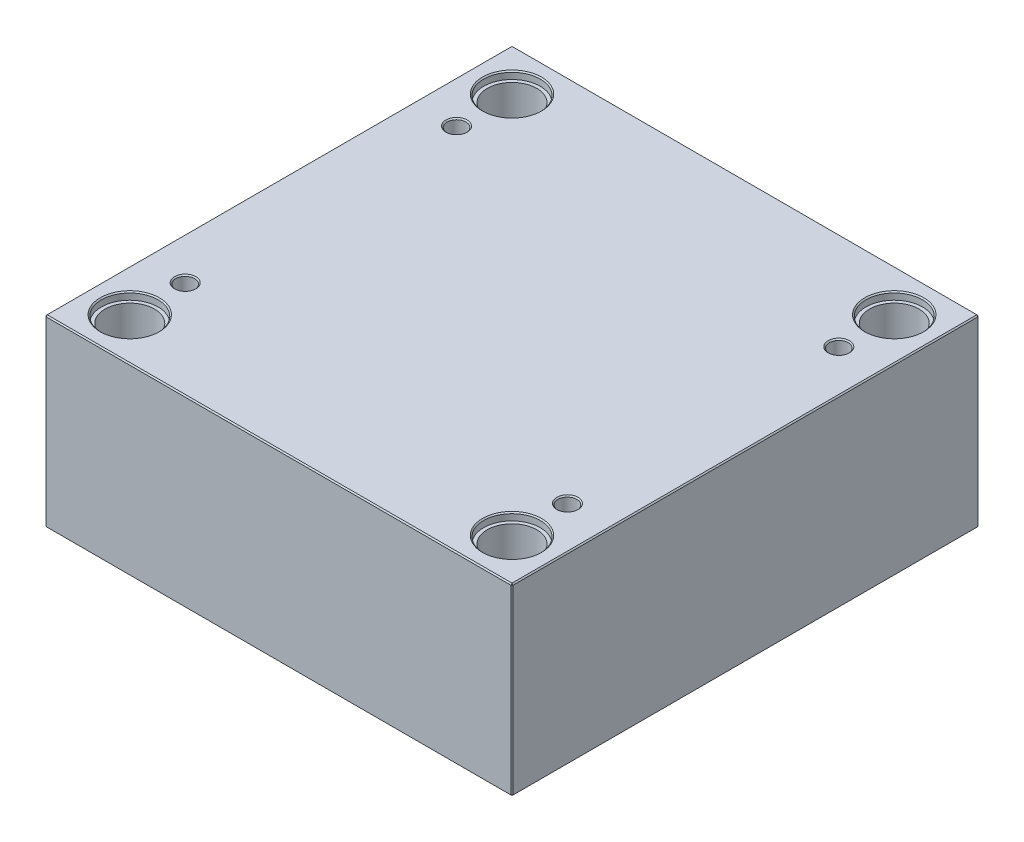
ISO-10303-21;
HEADER;
FILE_DESCRIPTION(('STEP AP214'),'2;1');
FILE_NAME('part.step','',(''),(''),'','','');
FILE_SCHEMA(('AUTOMOTIVE_DESIGN { 1 0 10303 214 1 1 1 1 }'));
ENDSEC;
DATA;
#1=APPLICATION_CONTEXT('core data for automotive mechanical design processes');
#2=APPLICATION_PROTOCOL_DEFINITION('international standard','automotive_design',2000,#1);
#3=PRODUCT_CONTEXT('',#1,'mechanical');
#4=PRODUCT('Part','Part','',(#3));
#5=PRODUCT_RELATED_PRODUCT_CATEGORY('part','',(#4));
#6=PRODUCT_DEFINITION_FORMATION('','',#4);
#7=PRODUCT_DEFINITION_CONTEXT('part definition',#1,'design');
#8=PRODUCT_DEFINITION('design','',#6,#7);
#9=PRODUCT_DEFINITION_SHAPE('','',#8);
#10=(LENGTH_UNIT() NAMED_UNIT(*) SI_UNIT(.MILLI.,.METRE.));
#11=(NAMED_UNIT(*) PLANE_ANGLE_UNIT() SI_UNIT($,.RADIAN.));
#12=(NAMED_UNIT(*) SI_UNIT($,.STERADIAN.) SOLID_ANGLE_UNIT());
#13=UNCERTAINTY_MEASURE_WITH_UNIT(LENGTH_MEASURE(1.E-05),#10,'distance_accuracy_value','');
#14=(GEOMETRIC_REPRESENTATION_CONTEXT(3) GLOBAL_UNCERTAINTY_ASSIGNED_CONTEXT((#13)) GLOBAL_UNIT_ASSIGNED_CONTEXT((#10,
#11,#12)) REPRESENTATION_CONTEXT('',''));
#15=CARTESIAN_POINT('',(0.,0.,0.));
#16=DIRECTION('',(0.,0.,1.));
#17=DIRECTION('',(1.,0.,0.));
#18=AXIS2_PLACEMENT_3D('',#15,#16,#17);
#19=CARTESIAN_POINT('',(-162.,0.,-162.));
#20=DIRECTION('',(0.,1.,0.));
#21=DIRECTION('',(0.,0.,1.));
#22=AXIS2_PLACEMENT_3D('',#19,#20,#21);
#23=CYLINDRICAL_SURFACE('',#22,21.);
#24=CARTESIAN_POINT('',(-162.,1.00000000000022,-162.));
#25=DIRECTION('',(0.,1.,0.));
#26=DIRECTION('',(0.,0.,1.));
#27=AXIS2_PLACEMENT_3D('',#24,#25,#26);
#28=CIRCLE('',#27,21.);
#29=CARTESIAN_POINT('',(-162.,1.00000000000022,-141.));
#30=VERTEX_POINT('',#29);
#31=EDGE_CURVE('E472',#30,#30,#28,.F.);
#32=ORIENTED_EDGE('',*,*,#31,.T.);
#33=EDGE_LOOP('',(#32));
#34=FACE_BOUND('',#33,.T.);
#35=CARTESIAN_POINT('',(-162.,149.7,-162.));
#36=DIRECTION('',(0.,1.,0.));
#37=DIRECTION('',(0.,0.,1.));
#38=AXIS2_PLACEMENT_3D('',#35,#36,#37);
#39=CIRCLE('',#38,21.);
#40=CARTESIAN_POINT('',(-162.,149.7,-141.));
#41=VERTEX_POINT('',#40);
#42=EDGE_CURVE('E221',#41,#41,#39,.F.);
#43=ORIENTED_EDGE('',*,*,#42,.F.);
#44=EDGE_LOOP('',(#43));
#45=FACE_BOUND('',#44,.T.);
#46=ADVANCED_FACE('F16',(#34,#45),#23,.F.);
#47=CARTESIAN_POINT('',(162.,0.,-162.));
#48=DIRECTION('',(0.,1.,0.));
#49=DIRECTION('',(0.,0.,1.));
#50=AXIS2_PLACEMENT_3D('',#47,#48,#49);
#51=CYLINDRICAL_SURFACE('',#50,21.);
#52=CARTESIAN_POINT('',(162.,1.00000000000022,-162.));
#53=DIRECTION('',(0.,1.,0.));
#54=DIRECTION('',(0.,0.,1.));
#55=AXIS2_PLACEMENT_3D('',#52,#53,#54);
#56=CIRCLE('',#55,21.);
#57=CARTESIAN_POINT('',(162.,1.00000000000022,-141.));
#58=VERTEX_POINT('',#57);
#59=EDGE_CURVE('E474',#58,#58,#56,.F.);
#60=ORIENTED_EDGE('',*,*,#59,.T.);
#61=EDGE_LOOP('',(#60));
#62=FACE_BOUND('',#61,.T.);
#63=CARTESIAN_POINT('',(162.,149.7,-162.));
#64=DIRECTION('',(0.,1.,0.));
#65=DIRECTION('',(0.,0.,1.));
#66=AXIS2_PLACEMENT_3D('',#63,#64,#65);
#67=CIRCLE('',#66,21.);
#68=CARTESIAN_POINT('',(162.,149.7,-141.));
#69=VERTEX_POINT('',#68);
#70=EDGE_CURVE('E218',#69,#69,#67,.F.);
#71=ORIENTED_EDGE('',*,*,#70,.F.);
#72=EDGE_LOOP('',(#71));
#73=FACE_BOUND('',#72,.T.);
#74=ADVANCED_FACE('F263',(#62,#73),#51,.F.);
#75=CARTESIAN_POINT('',(162.,0.,162.));
#76=DIRECTION('',(0.,1.,0.));
#77=DIRECTION('',(0.,0.,1.));
#78=AXIS2_PLACEMENT_3D('',#75,#76,#77);
#79=CYLINDRICAL_SURFACE('',#78,21.);
#80=CARTESIAN_POINT('',(162.,1.00000000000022,162.));
#81=DIRECTION('',(0.,1.,0.));
#82=DIRECTION('',(0.,0.,1.));
#83=AXIS2_PLACEMENT_3D('',#80,#81,#82);
#84=CIRCLE('',#83,21.);
#85=CARTESIAN_POINT('',(162.,1.00000000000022,183.));
#86=VERTEX_POINT('',#85);
#87=EDGE_CURVE('E477',#86,#86,#84,.F.);
#88=ORIENTED_EDGE('',*,*,#87,.T.);
#89=EDGE_LOOP('',(#88));
#90=FACE_BOUND('',#89,.T.);
#91=CARTESIAN_POINT('',(162.,149.7,162.));
#92=DIRECTION('',(0.,1.,0.));
#93=DIRECTION('',(0.,0.,1.));
#94=AXIS2_PLACEMENT_3D('',#91,#92,#93);
#95=CIRCLE('',#94,21.);
#96=CARTESIAN_POINT('',(162.,149.7,183.));
#97=VERTEX_POINT('',#96);
#98=EDGE_CURVE('E214',#97,#97,#95,.F.);
#99=ORIENTED_EDGE('',*,*,#98,.F.);
#100=EDGE_LOOP('',(#99));
#101=FACE_BOUND('',#100,.T.);
#102=ADVANCED_FACE('F270',(#90,#101),#79,.F.);
#103=CARTESIAN_POINT('',(-162.,0.,162.));
#104=DIRECTION('',(0.,1.,0.));
#105=DIRECTION('',(0.,0.,1.));
#106=AXIS2_PLACEMENT_3D('',#103,#104,#105);
#107=CYLINDRICAL_SURFACE('',#106,21.);
#108=CARTESIAN_POINT('',(-162.,1.00000000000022,162.));
#109=DIRECTION('',(0.,1.,0.));
#110=DIRECTION('',(0.,0.,1.));
#111=AXIS2_PLACEMENT_3D('',#108,#109,#110);
#112=CIRCLE('',#111,21.);
#113=CARTESIAN_POINT('',(-162.,1.00000000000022,183.));
#114=VERTEX_POINT('',#113);
#115=EDGE_CURVE('E480',#114,#114,#112,.F.);
#116=ORIENTED_EDGE('',*,*,#115,.T.);
#117=EDGE_LOOP('',(#116));
#118=FACE_BOUND('',#117,.T.);
#119=CARTESIAN_POINT('',(-162.,149.7,162.));
#120=DIRECTION('',(0.,1.,0.));
#121=DIRECTION('',(0.,0.,1.));
#122=AXIS2_PLACEMENT_3D('',#119,#120,#121);
#123=CIRCLE('',#122,21.);
#124=CARTESIAN_POINT('',(-162.,149.7,183.));
#125=VERTEX_POINT('',#124);
#126=EDGE_CURVE('E211',#125,#125,#123,.F.);
#127=ORIENTED_EDGE('',*,*,#126,.F.);
#128=EDGE_LOOP('',(#127));
#129=FACE_BOUND('',#128,.T.);
#130=ADVANCED_FACE('F277',(#118,#129),#107,.F.);
#131=CARTESIAN_POINT('',(-198.,156.,198.));
#132=DIRECTION('',(1.,0.,0.));
#133=DIRECTION('',(0.,0.,-1.));
#134=AXIS2_PLACEMENT_3D('',#131,#132,#133);
#135=PLANE('',#134);
#136=DIRECTION('',(0.,-1.,0.));
#137=VECTOR('',#136,1.);
#138=CARTESIAN_POINT('',(-198.,156.,-197.));
#139=LINE('',#138,#137);
#140=CARTESIAN_POINT('',(-198.,155.,-197.));
#141=VERTEX_POINT('',#140);
#142=CARTESIAN_POINT('',(-198.,1.00000000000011,-197.));
#143=VERTEX_POINT('',#142);
#144=EDGE_CURVE('E487',#141,#143,#139,.T.);
#145=ORIENTED_EDGE('',*,*,#144,.T.);
#146=DIRECTION('',(0.,0.,1.));
#147=VECTOR('',#146,1.);
#148=CARTESIAN_POINT('',(-198.,1.00000000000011,198.));
#149=LINE('',#148,#147);
#150=CARTESIAN_POINT('',(-198.,1.00000000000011,197.));
#151=VERTEX_POINT('',#150);
#152=EDGE_CURVE('E490',#143,#151,#149,.T.);
#153=ORIENTED_EDGE('',*,*,#152,.T.);
#154=DIRECTION('',(0.,1.,0.));
#155=VECTOR('',#154,1.);
#156=CARTESIAN_POINT('',(-198.,156.,197.));
#157=LINE('',#156,#155);
#158=CARTESIAN_POINT('',(-198.,155.,197.));
#159=VERTEX_POINT('',#158);
#160=EDGE_CURVE('E485',#151,#159,#157,.T.);
#161=ORIENTED_EDGE('',*,*,#160,.T.);
#162=DIRECTION('',(0.,0.,-1.));
#163=VECTOR('',#162,1.);
#164=CARTESIAN_POINT('',(-198.,155.,-198.));
#165=LINE('',#164,#163);
#166=EDGE_CURVE('E483',#159,#141,#165,.T.);
#167=ORIENTED_EDGE('',*,*,#166,.T.);
#168=EDGE_LOOP('',(#145,#153,#161,#167));
#169=FACE_BOUND('',#168,.T.);
#170=ADVANCED_FACE('F298',(#169),#135,.F.);
#171=CARTESIAN_POINT('',(198.,156.,198.));
#172=DIRECTION('',(0.,0.,-1.));
#173=DIRECTION('',(-1.,0.,0.));
#174=AXIS2_PLACEMENT_3D('',#171,#172,#173);
#175=PLANE('',#174);
#176=DIRECTION('',(-1.,0.,0.));
#177=VECTOR('',#176,1.);
#178=CARTESIAN_POINT('',(-198.,155.,198.));
#179=LINE('',#178,#177);
#180=CARTESIAN_POINT('',(197.,155.,198.));
#181=VERTEX_POINT('',#180);
#182=CARTESIAN_POINT('',(-197.,155.,198.));
#183=VERTEX_POINT('',#182);
#184=EDGE_CURVE('E509',#181,#183,#179,.T.);
#185=ORIENTED_EDGE('',*,*,#184,.T.);
#186=DIRECTION('',(0.,-1.,0.));
#187=VECTOR('',#186,1.);
#188=CARTESIAN_POINT('',(-197.,156.,198.));
#189=LINE('',#188,#187);
#190=CARTESIAN_POINT('',(-197.,1.00000000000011,198.));
#191=VERTEX_POINT('',#190);
#192=EDGE_CURVE('E515',#183,#191,#189,.T.);
#193=ORIENTED_EDGE('',*,*,#192,.T.);
#194=DIRECTION('',(1.,0.,0.));
#195=VECTOR('',#194,1.);
#196=CARTESIAN_POINT('',(198.,1.00000000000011,198.));
#197=LINE('',#196,#195);
#198=CARTESIAN_POINT('',(197.,1.00000000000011,198.));
#199=VERTEX_POINT('',#198);
#200=EDGE_CURVE('E513',#191,#199,#197,.T.);
#201=ORIENTED_EDGE('',*,*,#200,.T.);
#202=DIRECTION('',(0.,1.,0.));
#203=VECTOR('',#202,1.);
#204=CARTESIAN_POINT('',(197.,156.,198.));
#205=LINE('',#204,#203);
#206=EDGE_CURVE('E511',#199,#181,#205,.T.);
#207=ORIENTED_EDGE('',*,*,#206,.T.);
#208=EDGE_LOOP('',(#185,#193,#201,#207));
#209=FACE_BOUND('',#208,.T.);
#210=ADVANCED_FACE('F294',(#209),#175,.F.);
#211=CARTESIAN_POINT('',(198.,156.,198.));
#212=DIRECTION('',(-1.,0.,0.));
#213=DIRECTION('',(0.,0.,1.));
#214=AXIS2_PLACEMENT_3D('',#211,#212,#213);
#215=PLANE('',#214);
#216=DIRECTION('',(0.,0.,-1.));
#217=VECTOR('',#216,1.);
#218=CARTESIAN_POINT('',(198.,1.00000000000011,198.));
#219=LINE('',#218,#217);
#220=CARTESIAN_POINT('',(198.,1.00000000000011,197.));
#221=VERTEX_POINT('',#220);
#222=CARTESIAN_POINT('',(198.,1.00000000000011,-197.));
#223=VERTEX_POINT('',#222);
#224=EDGE_CURVE('E504',#221,#223,#219,.T.);
#225=ORIENTED_EDGE('',*,*,#224,.T.);
#226=DIRECTION('',(0.,1.,0.));
#227=VECTOR('',#226,1.);
#228=CARTESIAN_POINT('',(198.,156.,-197.));
#229=LINE('',#228,#227);
#230=CARTESIAN_POINT('',(198.,155.,-197.));
#231=VERTEX_POINT('',#230);
#232=EDGE_CURVE('E506',#223,#231,#229,.T.);
#233=ORIENTED_EDGE('',*,*,#232,.T.);
#234=DIRECTION('',(0.,0.,1.));
#235=VECTOR('',#234,1.);
#236=CARTESIAN_POINT('',(198.,155.,198.));
#237=LINE('',#236,#235);
#238=CARTESIAN_POINT('',(198.,155.,197.));
#239=VERTEX_POINT('',#238);
#240=EDGE_CURVE('E500',#231,#239,#237,.T.);
#241=ORIENTED_EDGE('',*,*,#240,.T.);
#242=DIRECTION('',(0.,-1.,0.));
#243=VECTOR('',#242,1.);
#244=CARTESIAN_POINT('',(198.,156.,197.));
#245=LINE('',#244,#243);
#246=EDGE_CURVE('E502',#239,#221,#245,.T.);
#247=ORIENTED_EDGE('',*,*,#246,.T.);
#248=EDGE_LOOP('',(#225,#233,#241,#247));
#249=FACE_BOUND('',#248,.T.);
#250=ADVANCED_FACE('F290',(#249),#215,.F.);
#251=CARTESIAN_POINT('',(198.,156.,-198.));
#252=DIRECTION('',(0.,0.,1.));
#253=DIRECTION('',(1.,0.,0.));
#254=AXIS2_PLACEMENT_3D('',#251,#252,#253);
#255=PLANE('',#254);
#256=DIRECTION('',(0.,-1.,0.));
#257=VECTOR('',#256,1.);
#258=CARTESIAN_POINT('',(197.,156.,-198.));
#259=LINE('',#258,#257);
#260=CARTESIAN_POINT('',(197.,155.,-198.));
#261=VERTEX_POINT('',#260);
#262=CARTESIAN_POINT('',(197.,1.00000000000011,-198.));
#263=VERTEX_POINT('',#262);
#264=EDGE_CURVE('E494',#261,#263,#259,.T.);
#265=ORIENTED_EDGE('',*,*,#264,.T.);
#266=DIRECTION('',(-1.,0.,0.));
#267=VECTOR('',#266,1.);
#268=CARTESIAN_POINT('',(198.,1.00000000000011,-198.));
#269=LINE('',#268,#267);
#270=CARTESIAN_POINT('',(-197.,1.00000000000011,-198.));
#271=VERTEX_POINT('',#270);
#272=EDGE_CURVE('E138',#263,#271,#269,.T.);
#273=ORIENTED_EDGE('',*,*,#272,.T.);
#274=DIRECTION('',(0.,1.,0.));
#275=VECTOR('',#274,1.);
#276=CARTESIAN_POINT('',(-197.,156.,-198.));
#277=LINE('',#276,#275);
#278=CARTESIAN_POINT('',(-197.,155.,-198.));
#279=VERTEX_POINT('',#278);
#280=EDGE_CURVE('E496',#271,#279,#277,.T.);
#281=ORIENTED_EDGE('',*,*,#280,.T.);
#282=DIRECTION('',(1.,0.,0.));
#283=VECTOR('',#282,1.);
#284=CARTESIAN_POINT('',(198.,155.,-198.));
#285=LINE('',#284,#283);
#286=EDGE_CURVE('E492',#279,#261,#285,.T.);
#287=ORIENTED_EDGE('',*,*,#286,.T.);
#288=EDGE_LOOP('',(#265,#273,#281,#287));
#289=FACE_BOUND('',#288,.T.);
#290=ADVANCED_FACE('F282',(#289),#255,.F.);
#291=CARTESIAN_POINT('',(0.,156.,0.));
#292=DIRECTION('',(0.,1.,0.));
#293=DIRECTION('',(0.,0.,1.));
#294=AXIS2_PLACEMENT_3D('',#291,#292,#293);
#295=PLANE('',#294);
#296=CARTESIAN_POINT('',(162.,156.,162.));
#297=DIRECTION('',(0.,1.,0.));
#298=DIRECTION('',(0.,0.,1.));
#299=AXIS2_PLACEMENT_3D('',#296,#297,#298);
#300=CIRCLE('',#299,25.);
#301=CARTESIAN_POINT('',(162.,156.,187.));
#302=VERTEX_POINT('',#301);
#303=EDGE_CURVE('E236',#302,#302,#300,.F.);
#304=ORIENTED_EDGE('',*,*,#303,.T.);
#305=EDGE_LOOP('',(#304));
#306=FACE_BOUND('',#305,.T.);
#307=CARTESIAN_POINT('',(-162.,156.,162.));
#308=DIRECTION('',(0.,1.,0.));
#309=DIRECTION('',(0.,0.,1.));
#310=AXIS2_PLACEMENT_3D('',#307,#308,#309);
#311=CIRCLE('',#310,25.);
#312=CARTESIAN_POINT('',(-162.,156.,187.));
#313=VERTEX_POINT('',#312);
#314=EDGE_CURVE('E233',#313,#313,#311,.F.);
#315=ORIENTED_EDGE('',*,*,#314,.T.);
#316=EDGE_LOOP('',(#315));
#317=FACE_BOUND('',#316,.T.);
#318=CARTESIAN_POINT('',(162.,156.,-162.));
#319=DIRECTION('',(0.,1.,0.));
#320=DIRECTION('',(0.,0.,1.));
#321=AXIS2_PLACEMENT_3D('',#318,#319,#320);
#322=CIRCLE('',#321,25.);
#323=CARTESIAN_POINT('',(162.,156.,-137.));
#324=VERTEX_POINT('',#323);
#325=EDGE_CURVE('E230',#324,#324,#322,.F.);
#326=ORIENTED_EDGE('',*,*,#325,.T.);
#327=EDGE_LOOP('',(#326));
#328=FACE_BOUND('',#327,.T.);
#329=CARTESIAN_POINT('',(-162.,156.,-162.));
#330=DIRECTION('',(0.,1.,0.));
#331=DIRECTION('',(0.,0.,1.));
#332=AXIS2_PLACEMENT_3D('',#329,#330,#331);
#333=CIRCLE('',#332,25.);
#334=CARTESIAN_POINT('',(-162.,156.,-137.));
#335=VERTEX_POINT('',#334);
#336=EDGE_CURVE('E227',#335,#335,#333,.F.);
#337=ORIENTED_EDGE('',*,*,#336,.T.);
#338=EDGE_LOOP('',(#337));
#339=FACE_BOUND('',#338,.T.);
#340=CARTESIAN_POINT('',(-162.,156.,115.));
#341=DIRECTION('',(0.,1.,0.));
#342=DIRECTION('',(0.,0.,1.));
#343=AXIS2_PLACEMENT_3D('',#340,#341,#342);
#344=CIRCLE('',#343,9.00000000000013);
#345=CARTESIAN_POINT('',(-162.,156.,124.));
#346=VERTEX_POINT('',#345);
#347=EDGE_CURVE('E198',#346,#346,#344,.F.);
#348=ORIENTED_EDGE('',*,*,#347,.T.);
#349=EDGE_LOOP('',(#348));
#350=FACE_BOUND('',#349,.T.);
#351=CARTESIAN_POINT('',(162.,156.,115.));
#352=DIRECTION('',(0.,1.,0.));
#353=DIRECTION('',(0.,0.,1.));
#354=AXIS2_PLACEMENT_3D('',#351,#352,#353);
#355=CIRCLE('',#354,9.00000000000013);
#356=CARTESIAN_POINT('',(162.,156.,124.));
#357=VERTEX_POINT('',#356);
#358=EDGE_CURVE('E195',#357,#357,#355,.F.);
#359=ORIENTED_EDGE('',*,*,#358,.T.);
#360=EDGE_LOOP('',(#359));
#361=FACE_BOUND('',#360,.T.);
#362=CARTESIAN_POINT('',(162.,156.,-115.));
#363=DIRECTION('',(0.,1.,0.));
#364=DIRECTION('',(0.,0.,1.));
#365=AXIS2_PLACEMENT_3D('',#362,#363,#364);
#366=CIRCLE('',#365,9.00000000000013);
#367=CARTESIAN_POINT('',(162.,156.,-106.));
#368=VERTEX_POINT('',#367);
#369=EDGE_CURVE('E192',#368,#368,#366,.F.);
#370=ORIENTED_EDGE('',*,*,#369,.T.);
#371=EDGE_LOOP('',(#370));
#372=FACE_BOUND('',#371,.T.);
#373=CARTESIAN_POINT('',(-162.,156.,-115.));
#374=DIRECTION('',(0.,1.,0.));
#375=DIRECTION('',(0.,0.,1.));
#376=AXIS2_PLACEMENT_3D('',#373,#374,#375);
#377=CIRCLE('',#376,9.00000000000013);
#378=CARTESIAN_POINT('',(-162.,156.,-106.));
#379=VERTEX_POINT('',#378);
#380=EDGE_CURVE('E188',#379,#379,#377,.F.);
#381=ORIENTED_EDGE('',*,*,#380,.T.);
#382=EDGE_LOOP('',(#381));
#383=FACE_BOUND('',#382,.T.);
#384=DIRECTION('',(0.,0.,-1.));
#385=VECTOR('',#384,1.);
#386=CARTESIAN_POINT('',(197.,156.,-198.));
#387=LINE('',#386,#385);
#388=CARTESIAN_POINT('',(197.,156.,197.));
#389=VERTEX_POINT('',#388);
#390=CARTESIAN_POINT('',(197.,156.,-197.));
#391=VERTEX_POINT('',#390);
#392=EDGE_CURVE('E31',#389,#391,#387,.T.);
#393=ORIENTED_EDGE('',*,*,#392,.T.);
#394=DIRECTION('',(-1.,0.,0.));
#395=VECTOR('',#394,1.);
#396=CARTESIAN_POINT('',(-198.,156.,-197.));
#397=LINE('',#396,#395);
#398=CARTESIAN_POINT('',(-197.,156.,-197.));
#399=VERTEX_POINT('',#398);
#400=EDGE_CURVE('E189',#391,#399,#397,.T.);
#401=ORIENTED_EDGE('',*,*,#400,.T.);
#402=DIRECTION('',(0.,0.,1.));
#403=VECTOR('',#402,1.);
#404=CARTESIAN_POINT('',(-197.,156.,198.));
#405=LINE('',#404,#403);
#406=CARTESIAN_POINT('',(-197.,156.,197.));
#407=VERTEX_POINT('',#406);
#408=EDGE_CURVE('E518',#399,#407,#405,.T.);
#409=ORIENTED_EDGE('',*,*,#408,.T.);
#410=DIRECTION('',(1.,0.,0.));
#411=VECTOR('',#410,1.);
#412=CARTESIAN_POINT('',(198.,156.,197.));
#413=LINE('',#412,#411);
#414=EDGE_CURVE('E36',#407,#389,#413,.T.);
#415=ORIENTED_EDGE('',*,*,#414,.T.);
#416=EDGE_LOOP('',(#393,#401,#409,#415));
#417=FACE_BOUND('',#416,.T.);
#418=ADVANCED_FACE('F279',(#306,#317,#328,#339,#350,#361,#372,#383,#417),#295,.T.);
#419=CARTESIAN_POINT('',(0.,0.,0.));
#420=DIRECTION('',(0.,1.,0.));
#421=DIRECTION('',(0.,0.,1.));
#422=AXIS2_PLACEMENT_3D('',#419,#420,#421);
#423=PLANE('',#422);
#424=CARTESIAN_POINT('',(-162.,0.,-162.));
#425=DIRECTION('',(0.,1.,0.));
#426=DIRECTION('',(0.,0.,1.));
#427=AXIS2_PLACEMENT_3D('',#424,#425,#426);
#428=CIRCLE('',#427,22.);
#429=CARTESIAN_POINT('',(-162.,0.,-140.));
#430=VERTEX_POINT('',#429);
#431=EDGE_CURVE('E469',#430,#430,#428,.T.);
#432=ORIENTED_EDGE('',*,*,#431,.T.);
#433=EDGE_LOOP('',(#432));
#434=FACE_BOUND('',#433,.T.);
#435=CARTESIAN_POINT('',(162.,0.,-162.));
#436=DIRECTION('',(0.,1.,0.));
#437=DIRECTION('',(0.,0.,1.));
#438=AXIS2_PLACEMENT_3D('',#435,#436,#437);
#439=CIRCLE('',#438,22.);
#440=CARTESIAN_POINT('',(162.,0.,-140.));
#441=VERTEX_POINT('',#440);
#442=EDGE_CURVE('E466',#441,#441,#439,.T.);
#443=ORIENTED_EDGE('',*,*,#442,.T.);
#444=EDGE_LOOP('',(#443));
#445=FACE_BOUND('',#444,.T.);
#446=CARTESIAN_POINT('',(162.,0.,162.));
#447=DIRECTION('',(0.,1.,0.));
#448=DIRECTION('',(0.,0.,1.));
#449=AXIS2_PLACEMENT_3D('',#446,#447,#448);
#450=CIRCLE('',#449,22.);
#451=CARTESIAN_POINT('',(162.,0.,184.));
#452=VERTEX_POINT('',#451);
#453=EDGE_CURVE('E463',#452,#452,#450,.T.);
#454=ORIENTED_EDGE('',*,*,#453,.T.);
#455=EDGE_LOOP('',(#454));
#456=FACE_BOUND('',#455,.T.);
#457=CARTESIAN_POINT('',(-162.,0.,162.));
#458=DIRECTION('',(0.,1.,0.));
#459=DIRECTION('',(0.,0.,1.));
#460=AXIS2_PLACEMENT_3D('',#457,#458,#459);
#461=CIRCLE('',#460,22.);
#462=CARTESIAN_POINT('',(-162.,0.,184.));
#463=VERTEX_POINT('',#462);
#464=EDGE_CURVE('E460',#463,#463,#461,.T.);
#465=ORIENTED_EDGE('',*,*,#464,.T.);
#466=EDGE_LOOP('',(#465));
#467=FACE_BOUND('',#466,.T.);
#468=DIRECTION('',(0.,0.,1.));
#469=VECTOR('',#468,1.);
#470=CARTESIAN_POINT('',(197.,0.,0.));
#471=LINE('',#470,#469);
#472=CARTESIAN_POINT('',(197.,0.,-197.));
#473=VERTEX_POINT('',#472);
#474=CARTESIAN_POINT('',(197.,0.,197.));
#475=VERTEX_POINT('',#474);
#476=EDGE_CURVE('E108',#473,#475,#471,.T.);
#477=ORIENTED_EDGE('',*,*,#476,.T.);
#478=DIRECTION('',(-1.,0.,0.));
#479=VECTOR('',#478,1.);
#480=CARTESIAN_POINT('',(0.,0.,197.));
#481=LINE('',#480,#479);
#482=CARTESIAN_POINT('',(-197.,0.,197.));
#483=VERTEX_POINT('',#482);
#484=EDGE_CURVE('E458',#475,#483,#481,.T.);
#485=ORIENTED_EDGE('',*,*,#484,.T.);
#486=DIRECTION('',(0.,0.,-1.));
#487=VECTOR('',#486,1.);
#488=CARTESIAN_POINT('',(-197.,0.,0.));
#489=LINE('',#488,#487);
#490=CARTESIAN_POINT('',(-197.,0.,-197.));
#491=VERTEX_POINT('',#490);
#492=EDGE_CURVE('E110',#483,#491,#489,.T.);
#493=ORIENTED_EDGE('',*,*,#492,.T.);
#494=DIRECTION('',(1.,0.,0.));
#495=VECTOR('',#494,1.);
#496=CARTESIAN_POINT('',(0.,0.,-197.));
#497=LINE('',#496,#495);
#498=EDGE_CURVE('E104',#491,#473,#497,.T.);
#499=ORIENTED_EDGE('',*,*,#498,.T.);
#500=EDGE_LOOP('',(#477,#485,#493,#499));
#501=FACE_BOUND('',#500,.T.);
#502=ADVANCED_FACE('F106',(#434,#445,#456,#467,#501),#423,.F.);
#503=CARTESIAN_POINT('',(-162.,0.,-162.));
#504=DIRECTION('',(0.,-1.,0.));
#505=DIRECTION('',(0.,0.,-1.));
#506=AXIS2_PLACEMENT_3D('',#503,#504,#505);
#507=CONICAL_SURFACE('',#506,22.,0.785398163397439);
#508=ORIENTED_EDGE('',*,*,#31,.F.);
#509=EDGE_LOOP('',(#508));
#510=FACE_BOUND('',#509,.T.);
#511=ORIENTED_EDGE('',*,*,#431,.F.);
#512=EDGE_LOOP('',(#511));
#513=FACE_BOUND('',#512,.T.);
#514=ADVANCED_FACE('F286',(#510,#513),#507,.F.);
#515=CARTESIAN_POINT('',(162.,0.,-162.));
#516=DIRECTION('',(0.,-1.,0.));
#517=DIRECTION('',(0.,0.,-1.));
#518=AXIS2_PLACEMENT_3D('',#515,#516,#517);
#519=CONICAL_SURFACE('',#518,22.,0.785398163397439);
#520=ORIENTED_EDGE('',*,*,#59,.F.);
#521=EDGE_LOOP('',(#520));
#522=FACE_BOUND('',#521,.T.);
#523=ORIENTED_EDGE('',*,*,#442,.F.);
#524=EDGE_LOOP('',(#523));
#525=FACE_BOUND('',#524,.T.);
#526=ADVANCED_FACE('F305',(#522,#525),#519,.F.);
#527=CARTESIAN_POINT('',(162.,0.,162.));
#528=DIRECTION('',(0.,-1.,0.));
#529=DIRECTION('',(0.,0.,-1.));
#530=AXIS2_PLACEMENT_3D('',#527,#528,#529);
#531=CONICAL_SURFACE('',#530,22.,0.785398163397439);
#532=ORIENTED_EDGE('',*,*,#87,.F.);
#533=EDGE_LOOP('',(#532));
#534=FACE_BOUND('',#533,.T.);
#535=ORIENTED_EDGE('',*,*,#453,.F.);
#536=EDGE_LOOP('',(#535));
#537=FACE_BOUND('',#536,.T.);
#538=ADVANCED_FACE('F309',(#534,#537),#531,.F.);
#539=CARTESIAN_POINT('',(-162.,0.,162.));
#540=DIRECTION('',(0.,-1.,0.));
#541=DIRECTION('',(0.,0.,-1.));
#542=AXIS2_PLACEMENT_3D('',#539,#540,#541);
#543=CONICAL_SURFACE('',#542,22.,0.785398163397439);
#544=ORIENTED_EDGE('',*,*,#115,.F.);
#545=EDGE_LOOP('',(#544));
#546=FACE_BOUND('',#545,.T.);
#547=ORIENTED_EDGE('',*,*,#464,.F.);
#548=EDGE_LOOP('',(#547));
#549=FACE_BOUND('',#548,.T.);
#550=ADVANCED_FACE('F313',(#546,#549),#543,.F.);
#551=CARTESIAN_POINT('',(198.,156.,197.));
#552=DIRECTION('',(-0.707106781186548,0.,-0.707106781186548));
#553=DIRECTION('',(0.,-1.,0.));
#554=AXIS2_PLACEMENT_3D('',#551,#552,#553);
#555=PLANE('',#554);
#556=DIRECTION('',(-0.707106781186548,0.,0.707106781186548));
#557=VECTOR('',#556,1.);
#558=CARTESIAN_POINT('',(197.,155.,198.));
#559=LINE('',#558,#557);
#560=EDGE_CURVE('E126',#181,#239,#559,.F.);
#561=ORIENTED_EDGE('',*,*,#560,.F.);
#562=ORIENTED_EDGE('',*,*,#206,.F.);
#563=DIRECTION('',(0.707106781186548,0.,-0.707106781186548));
#564=VECTOR('',#563,1.);
#565=CARTESIAN_POINT('',(197.,1.00000000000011,198.));
#566=LINE('',#565,#564);
#567=EDGE_CURVE('E180',#221,#199,#566,.F.);
#568=ORIENTED_EDGE('',*,*,#567,.F.);
#569=ORIENTED_EDGE('',*,*,#246,.F.);
#570=EDGE_LOOP('',(#561,#562,#568,#569));
#571=FACE_BOUND('',#570,.T.);
#572=ADVANCED_FACE('F317',(#571),#555,.F.);
#573=CARTESIAN_POINT('',(197.,155.,198.));
#574=DIRECTION('',(0.577350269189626,0.577350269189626,0.577350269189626));
#575=DIRECTION('',(0.707106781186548,0.,-0.707106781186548));
#576=AXIS2_PLACEMENT_3D('',#573,#574,#575);
#577=PLANE('',#576);
#578=DIRECTION('',(0.,-0.707106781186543,0.707106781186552));
#579=VECTOR('',#578,1.);
#580=CARTESIAN_POINT('',(197.,155.,198.));
#581=LINE('',#580,#579);
#582=EDGE_CURVE('E175',#181,#389,#581,.F.);
#583=ORIENTED_EDGE('',*,*,#582,.F.);
#584=ORIENTED_EDGE('',*,*,#560,.T.);
#585=DIRECTION('',(-0.707106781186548,0.707106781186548,0.));
#586=VECTOR('',#585,1.);
#587=CARTESIAN_POINT('',(197.5,155.5,197.));
#588=LINE('',#587,#586);
#589=EDGE_CURVE('E177',#389,#239,#588,.F.);
#590=ORIENTED_EDGE('',*,*,#589,.F.);
#591=EDGE_LOOP('',(#583,#584,#590));
#592=FACE_BOUND('',#591,.T.);
#593=ADVANCED_FACE('F385',(#592),#577,.T.);
#594=CARTESIAN_POINT('',(197.,1.00000000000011,198.));
#595=DIRECTION('',(0.577350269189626,-0.577350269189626,0.577350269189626));
#596=DIRECTION('',(0.707106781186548,0.,-0.707106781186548));
#597=AXIS2_PLACEMENT_3D('',#594,#595,#596);
#598=PLANE('',#597);
#599=DIRECTION('',(-0.707106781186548,-0.707106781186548,0.));
#600=VECTOR('',#599,1.);
#601=CARTESIAN_POINT('',(197.5,0.500000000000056,197.));
#602=LINE('',#601,#600);
#603=EDGE_CURVE('E124',#221,#475,#602,.T.);
#604=ORIENTED_EDGE('',*,*,#603,.F.);
#605=ORIENTED_EDGE('',*,*,#567,.T.);
#606=DIRECTION('',(0.,0.707106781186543,0.707106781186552));
#607=VECTOR('',#606,1.);
#608=CARTESIAN_POINT('',(197.,1.00000000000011,198.));
#609=LINE('',#608,#607);
#610=EDGE_CURVE('E172',#475,#199,#609,.T.);
#611=ORIENTED_EDGE('',*,*,#610,.F.);
#612=EDGE_LOOP('',(#604,#605,#611));
#613=FACE_BOUND('',#612,.T.);
#614=ADVANCED_FACE('F381',(#613),#598,.T.);
#615=CARTESIAN_POINT('',(197.,156.,0.));
#616=DIRECTION('',(0.707106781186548,0.707106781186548,0.));
#617=DIRECTION('',(0.,0.,1.));
#618=AXIS2_PLACEMENT_3D('',#615,#616,#617);
#619=PLANE('',#618);
#620=ORIENTED_EDGE('',*,*,#589,.T.);
#621=ORIENTED_EDGE('',*,*,#240,.F.);
#622=DIRECTION('',(0.707106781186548,-0.707106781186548,0.));
#623=VECTOR('',#622,1.);
#624=CARTESIAN_POINT('',(198.,155.,-197.));
#625=LINE('',#624,#623);
#626=EDGE_CURVE('E166',#391,#231,#625,.T.);
#627=ORIENTED_EDGE('',*,*,#626,.F.);
#628=ORIENTED_EDGE('',*,*,#392,.F.);
#629=EDGE_LOOP('',(#620,#621,#627,#628));
#630=FACE_BOUND('',#629,.T.);
#631=ADVANCED_FACE('F377',(#630),#619,.T.);
#632=CARTESIAN_POINT('',(0.,156.,197.));
#633=DIRECTION('',(0.,0.707106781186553,0.707106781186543));
#634=DIRECTION('',(-1.,0.,0.));
#635=AXIS2_PLACEMENT_3D('',#632,#633,#634);
#636=PLANE('',#635);
#637=ORIENTED_EDGE('',*,*,#582,.T.);
#638=ORIENTED_EDGE('',*,*,#414,.F.);
#639=DIRECTION('',(0.,0.707106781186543,-0.707106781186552));
#640=VECTOR('',#639,1.);
#641=CARTESIAN_POINT('',(-197.,155.5,197.5));
#642=LINE('',#641,#640);
#643=EDGE_CURVE('E163',#183,#407,#642,.T.);
#644=ORIENTED_EDGE('',*,*,#643,.F.);
#645=ORIENTED_EDGE('',*,*,#184,.F.);
#646=EDGE_LOOP('',(#637,#638,#644,#645));
#647=FACE_BOUND('',#646,.T.);
#648=ADVANCED_FACE('F373',(#647),#636,.T.);
#649=CARTESIAN_POINT('',(-197.,156.,198.));
#650=DIRECTION('',(0.707106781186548,0.,-0.707106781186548));
#651=DIRECTION('',(0.,-1.,0.));
#652=AXIS2_PLACEMENT_3D('',#649,#650,#651);
#653=PLANE('',#652);
#654=DIRECTION('',(0.707106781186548,0.,0.707106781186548));
#655=VECTOR('',#654,1.);
#656=CARTESIAN_POINT('',(-197.,1.00000000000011,198.));
#657=LINE('',#656,#655);
#658=EDGE_CURVE('E157',#191,#151,#657,.F.);
#659=ORIENTED_EDGE('',*,*,#658,.F.);
#660=ORIENTED_EDGE('',*,*,#192,.F.);
#661=DIRECTION('',(-0.707106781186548,0.,-0.707106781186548));
#662=VECTOR('',#661,1.);
#663=CARTESIAN_POINT('',(-198.,155.,197.));
#664=LINE('',#663,#662);
#665=EDGE_CURVE('E160',#159,#183,#664,.F.);
#666=ORIENTED_EDGE('',*,*,#665,.F.);
#667=ORIENTED_EDGE('',*,*,#160,.F.);
#668=EDGE_LOOP('',(#659,#660,#666,#667));
#669=FACE_BOUND('',#668,.T.);
#670=ADVANCED_FACE('F369',(#669),#653,.F.);
#671=CARTESIAN_POINT('',(198.,1.00000000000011,198.));
#672=DIRECTION('',(0.,0.707106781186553,-0.707106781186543));
#673=DIRECTION('',(1.,0.,0.));
#674=AXIS2_PLACEMENT_3D('',#671,#672,#673);
#675=PLANE('',#674);
#676=ORIENTED_EDGE('',*,*,#610,.T.);
#677=ORIENTED_EDGE('',*,*,#200,.F.);
#678=DIRECTION('',(0.,-0.707106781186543,-0.707106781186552));
#679=VECTOR('',#678,1.);
#680=CARTESIAN_POINT('',(-197.,1.00000000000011,198.));
#681=LINE('',#680,#679);
#682=EDGE_CURVE('E135',#483,#191,#681,.F.);
#683=ORIENTED_EDGE('',*,*,#682,.F.);
#684=ORIENTED_EDGE('',*,*,#484,.F.);
#685=EDGE_LOOP('',(#676,#677,#683,#684));
#686=FACE_BOUND('',#685,.T.);
#687=ADVANCED_FACE('F366',(#686),#675,.F.);
#688=CARTESIAN_POINT('',(198.,1.00000000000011,198.));
#689=DIRECTION('',(-0.707106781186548,0.707106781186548,0.));
#690=DIRECTION('',(0.,0.,-1.));
#691=AXIS2_PLACEMENT_3D('',#688,#689,#690);
#692=PLANE('',#691);
#693=ORIENTED_EDGE('',*,*,#603,.T.);
#694=ORIENTED_EDGE('',*,*,#476,.F.);
#695=DIRECTION('',(0.707106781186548,0.707106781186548,0.));
#696=VECTOR('',#695,1.);
#697=CARTESIAN_POINT('',(197.5,0.500000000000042,-197.));
#698=LINE('',#697,#696);
#699=EDGE_CURVE('E121',#223,#473,#698,.F.);
#700=ORIENTED_EDGE('',*,*,#699,.F.);
#701=ORIENTED_EDGE('',*,*,#224,.F.);
#702=EDGE_LOOP('',(#693,#694,#700,#701));
#703=FACE_BOUND('',#702,.T.);
#704=ADVANCED_FACE('F119',(#703),#692,.F.);
#705=CARTESIAN_POINT('',(197.,156.,-198.));
#706=DIRECTION('',(-0.707106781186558,0.,0.707106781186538));
#707=DIRECTION('',(0.,-1.,0.));
#708=AXIS2_PLACEMENT_3D('',#705,#706,#707);
#709=PLANE('',#708);
#710=DIRECTION('',(0.707106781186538,0.,0.707106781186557));
#711=VECTOR('',#710,1.);
#712=CARTESIAN_POINT('',(198.,155.,-197.));
#713=LINE('',#712,#711);
#714=EDGE_CURVE('E168',#231,#261,#713,.F.);
#715=ORIENTED_EDGE('',*,*,#714,.F.);
#716=ORIENTED_EDGE('',*,*,#232,.F.);
#717=DIRECTION('',(-0.707106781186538,0.,-0.707106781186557));
#718=VECTOR('',#717,1.);
#719=CARTESIAN_POINT('',(197.,1.00000000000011,-198.));
#720=LINE('',#719,#718);
#721=EDGE_CURVE('E134',#263,#223,#720,.F.);
#722=ORIENTED_EDGE('',*,*,#721,.F.);
#723=ORIENTED_EDGE('',*,*,#264,.F.);
#724=EDGE_LOOP('',(#715,#716,#722,#723));
#725=FACE_BOUND('',#724,.T.);
#726=ADVANCED_FACE('F359',(#725),#709,.F.);
#727=CARTESIAN_POINT('',(198.,155.,-197.));
#728=DIRECTION('',(0.577350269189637,0.577350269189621,-0.577350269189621));
#729=DIRECTION('',(-0.707106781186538,0.,-0.707106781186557));
#730=AXIS2_PLACEMENT_3D('',#727,#728,#729);
#731=PLANE('',#730);
#732=ORIENTED_EDGE('',*,*,#626,.T.);
#733=ORIENTED_EDGE('',*,*,#714,.T.);
#734=DIRECTION('',(0.,0.707106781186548,0.707106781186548));
#735=VECTOR('',#734,1.);
#736=CARTESIAN_POINT('',(197.,155.5,-197.5));
#737=LINE('',#736,#735);
#738=EDGE_CURVE('E152',#391,#261,#737,.F.);
#739=ORIENTED_EDGE('',*,*,#738,.F.);
#740=EDGE_LOOP('',(#732,#733,#739));
#741=FACE_BOUND('',#740,.T.);
#742=ADVANCED_FACE('F355',(#741),#731,.T.);
#743=CARTESIAN_POINT('',(-198.,155.,197.));
#744=DIRECTION('',(-0.577350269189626,0.577350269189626,0.577350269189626));
#745=DIRECTION('',(0.707106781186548,0.,0.707106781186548));
#746=AXIS2_PLACEMENT_3D('',#743,#744,#745);
#747=PLANE('',#746);
#748=ORIENTED_EDGE('',*,*,#665,.T.);
#749=ORIENTED_EDGE('',*,*,#643,.T.);
#750=DIRECTION('',(-0.707106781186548,-0.707106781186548,0.));
#751=VECTOR('',#750,1.);
#752=CARTESIAN_POINT('',(-198.,155.,197.));
#753=LINE('',#752,#751);
#754=EDGE_CURVE('E143',#159,#407,#753,.F.);
#755=ORIENTED_EDGE('',*,*,#754,.F.);
#756=EDGE_LOOP('',(#748,#749,#755));
#757=FACE_BOUND('',#756,.T.);
#758=ADVANCED_FACE('F351',(#757),#747,.T.);
#759=CARTESIAN_POINT('',(-197.,1.00000000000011,198.));
#760=DIRECTION('',(-0.577350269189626,-0.577350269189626,0.577350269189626));
#761=DIRECTION('',(0.707106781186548,0.,0.707106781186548));
#762=AXIS2_PLACEMENT_3D('',#759,#760,#761);
#763=PLANE('',#762);
#764=ORIENTED_EDGE('',*,*,#682,.T.);
#765=ORIENTED_EDGE('',*,*,#658,.T.);
#766=DIRECTION('',(-0.707106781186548,0.707106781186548,0.));
#767=VECTOR('',#766,1.);
#768=CARTESIAN_POINT('',(-197.5,0.500000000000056,197.));
#769=LINE('',#768,#767);
#770=EDGE_CURVE('E139',#483,#151,#769,.T.);
#771=ORIENTED_EDGE('',*,*,#770,.F.);
#772=EDGE_LOOP('',(#764,#765,#771));
#773=FACE_BOUND('',#772,.T.);
#774=ADVANCED_FACE('F348',(#773),#763,.T.);
#775=CARTESIAN_POINT('',(197.,1.00000000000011,-198.));
#776=DIRECTION('',(0.577350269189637,-0.577350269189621,-0.577350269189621));
#777=DIRECTION('',(-0.707106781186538,0.,-0.707106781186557));
#778=AXIS2_PLACEMENT_3D('',#775,#776,#777);
#779=PLANE('',#778);
#780=ORIENTED_EDGE('',*,*,#721,.T.);
#781=ORIENTED_EDGE('',*,*,#699,.T.);
#782=DIRECTION('',(0.,-0.707106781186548,0.707106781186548));
#783=VECTOR('',#782,1.);
#784=CARTESIAN_POINT('',(197.,1.00000000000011,-198.));
#785=LINE('',#784,#783);
#786=EDGE_CURVE('E131',#263,#473,#785,.T.);
#787=ORIENTED_EDGE('',*,*,#786,.F.);
#788=EDGE_LOOP('',(#780,#781,#787));
#789=FACE_BOUND('',#788,.T.);
#790=ADVANCED_FACE('F130',(#789),#779,.T.);
#791=CARTESIAN_POINT('',(0.,156.,-197.));
#792=DIRECTION('',(0.,0.707106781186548,-0.707106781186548));
#793=DIRECTION('',(1.,0.,0.));
#794=AXIS2_PLACEMENT_3D('',#791,#792,#793);
#795=PLANE('',#794);
#796=ORIENTED_EDGE('',*,*,#738,.T.);
#797=ORIENTED_EDGE('',*,*,#286,.F.);
#798=DIRECTION('',(0.,-0.707106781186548,-0.707106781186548));
#799=VECTOR('',#798,1.);
#800=CARTESIAN_POINT('',(-197.,155.,-198.));
#801=LINE('',#800,#799);
#802=EDGE_CURVE('E140',#399,#279,#801,.T.);
#803=ORIENTED_EDGE('',*,*,#802,.F.);
#804=ORIENTED_EDGE('',*,*,#400,.F.);
#805=EDGE_LOOP('',(#796,#797,#803,#804));
#806=FACE_BOUND('',#805,.T.);
#807=ADVANCED_FACE('F341',(#806),#795,.T.);
#808=CARTESIAN_POINT('',(-197.,156.,0.));
#809=DIRECTION('',(-0.707106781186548,0.707106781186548,0.));
#810=DIRECTION('',(0.,0.,-1.));
#811=AXIS2_PLACEMENT_3D('',#808,#809,#810);
#812=PLANE('',#811);
#813=ORIENTED_EDGE('',*,*,#754,.T.);
#814=ORIENTED_EDGE('',*,*,#408,.F.);
#815=DIRECTION('',(0.707106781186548,0.707106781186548,0.));
#816=VECTOR('',#815,1.);
#817=CARTESIAN_POINT('',(-197.5,155.5,-197.));
#818=LINE('',#817,#816);
#819=EDGE_CURVE('E146',#141,#399,#818,.T.);
#820=ORIENTED_EDGE('',*,*,#819,.F.);
#821=ORIENTED_EDGE('',*,*,#166,.F.);
#822=EDGE_LOOP('',(#813,#814,#820,#821));
#823=FACE_BOUND('',#822,.T.);
#824=ADVANCED_FACE('F337',(#823),#812,.T.);
#825=CARTESIAN_POINT('',(-198.,1.00000000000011,198.));
#826=DIRECTION('',(0.707106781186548,0.707106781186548,0.));
#827=DIRECTION('',(0.,0.,1.));
#828=AXIS2_PLACEMENT_3D('',#825,#826,#827);
#829=PLANE('',#828);
#830=ORIENTED_EDGE('',*,*,#770,.T.);
#831=ORIENTED_EDGE('',*,*,#152,.F.);
#832=DIRECTION('',(0.707106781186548,-0.707106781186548,0.));
#833=VECTOR('',#832,1.);
#834=CARTESIAN_POINT('',(-198.,1.00000000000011,-197.));
#835=LINE('',#834,#833);
#836=EDGE_CURVE('E529',#491,#143,#835,.F.);
#837=ORIENTED_EDGE('',*,*,#836,.F.);
#838=ORIENTED_EDGE('',*,*,#492,.F.);
#839=EDGE_LOOP('',(#830,#831,#837,#838));
#840=FACE_BOUND('',#839,.T.);
#841=ADVANCED_FACE('F334',(#840),#829,.F.);
#842=CARTESIAN_POINT('',(198.,1.00000000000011,-198.));
#843=DIRECTION('',(0.,0.707106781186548,0.707106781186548));
#844=DIRECTION('',(-1.,0.,0.));
#845=AXIS2_PLACEMENT_3D('',#842,#843,#844);
#846=PLANE('',#845);
#847=ORIENTED_EDGE('',*,*,#786,.T.);
#848=ORIENTED_EDGE('',*,*,#498,.F.);
#849=DIRECTION('',(0.,0.707106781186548,-0.707106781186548));
#850=VECTOR('',#849,1.);
#851=CARTESIAN_POINT('',(-197.,0.500000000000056,-197.5));
#852=LINE('',#851,#850);
#853=EDGE_CURVE('E526',#271,#491,#852,.F.);
#854=ORIENTED_EDGE('',*,*,#853,.F.);
#855=ORIENTED_EDGE('',*,*,#272,.F.);
#856=EDGE_LOOP('',(#847,#848,#854,#855));
#857=FACE_BOUND('',#856,.T.);
#858=ADVANCED_FACE('F137',(#857),#846,.F.);
#859=CARTESIAN_POINT('',(-197.,155.,-198.));
#860=DIRECTION('',(-0.577350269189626,0.577350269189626,-0.577350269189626));
#861=DIRECTION('',(-0.707106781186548,0.,0.707106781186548));
#862=AXIS2_PLACEMENT_3D('',#859,#860,#861);
#863=PLANE('',#862);
#864=ORIENTED_EDGE('',*,*,#819,.T.);
#865=ORIENTED_EDGE('',*,*,#802,.T.);
#866=DIRECTION('',(0.707106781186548,0.,-0.707106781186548));
#867=VECTOR('',#866,1.);
#868=CARTESIAN_POINT('',(-197.,155.,-198.));
#869=LINE('',#868,#867);
#870=EDGE_CURVE('E524',#141,#279,#869,.T.);
#871=ORIENTED_EDGE('',*,*,#870,.F.);
#872=EDGE_LOOP('',(#864,#865,#871));
#873=FACE_BOUND('',#872,.T.);
#874=ADVANCED_FACE('F327',(#873),#863,.T.);
#875=CARTESIAN_POINT('',(-198.,1.00000000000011,-197.));
#876=DIRECTION('',(-0.577350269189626,-0.577350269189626,-0.577350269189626));
#877=DIRECTION('',(-0.707106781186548,0.,0.707106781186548));
#878=AXIS2_PLACEMENT_3D('',#875,#876,#877);
#879=PLANE('',#878);
#880=ORIENTED_EDGE('',*,*,#853,.T.);
#881=ORIENTED_EDGE('',*,*,#836,.T.);
#882=DIRECTION('',(-0.707106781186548,0.,0.707106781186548));
#883=VECTOR('',#882,1.);
#884=CARTESIAN_POINT('',(-198.,1.00000000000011,-197.));
#885=LINE('',#884,#883);
#886=EDGE_CURVE('E455',#271,#143,#885,.T.);
#887=ORIENTED_EDGE('',*,*,#886,.F.);
#888=EDGE_LOOP('',(#880,#881,#887));
#889=FACE_BOUND('',#888,.T.);
#890=ADVANCED_FACE('F323',(#889),#879,.T.);
#891=CARTESIAN_POINT('',(-198.,156.,-197.));
#892=DIRECTION('',(0.707106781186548,0.,0.707106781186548));
#893=DIRECTION('',(0.,-1.,0.));
#894=AXIS2_PLACEMENT_3D('',#891,#892,#893);
#895=PLANE('',#894);
#896=ORIENTED_EDGE('',*,*,#870,.T.);
#897=ORIENTED_EDGE('',*,*,#280,.F.);
#898=ORIENTED_EDGE('',*,*,#886,.T.);
#899=ORIENTED_EDGE('',*,*,#144,.F.);
#900=EDGE_LOOP('',(#896,#897,#898,#899));
#901=FACE_BOUND('',#900,.T.);
#902=ADVANCED_FACE('F319',(#901),#895,.F.);
#903=CARTESIAN_POINT('',(-162.,131.,-115.));
#904=DIRECTION('',(0.,1.,0.));
#905=DIRECTION('',(0.,0.,1.));
#906=AXIS2_PLACEMENT_3D('',#903,#904,#905);
#907=CYLINDRICAL_SURFACE('',#906,8.);
#908=CARTESIAN_POINT('',(-162.,155.,-115.));
#909=DIRECTION('',(0.,1.,0.));
#910=DIRECTION('',(0.,0.,1.));
#911=AXIS2_PLACEMENT_3D('',#908,#909,#910);
#912=CIRCLE('',#911,8.);
#913=CARTESIAN_POINT('',(-162.,155.,-107.));
#914=VERTEX_POINT('',#913);
#915=EDGE_CURVE('E207',#914,#914,#912,.T.);
#916=ORIENTED_EDGE('',*,*,#915,.T.);
#917=EDGE_LOOP('',(#916));
#918=FACE_BOUND('',#917,.T.);
#919=CARTESIAN_POINT('',(-162.,131.,-115.));
#920=DIRECTION('',(0.,1.,0.));
#921=DIRECTION('',(0.,0.,1.));
#922=AXIS2_PLACEMENT_3D('',#919,#920,#921);
#923=CIRCLE('',#922,8.);
#924=CARTESIAN_POINT('',(-162.,131.,-107.));
#925=VERTEX_POINT('',#924);
#926=EDGE_CURVE('E448',#925,#925,#923,.T.);
#927=ORIENTED_EDGE('',*,*,#926,.F.);
#928=EDGE_LOOP('',(#927));
#929=FACE_BOUND('',#928,.T.);
#930=ADVANCED_FACE('F322',(#918,#929),#907,.F.);
#931=CARTESIAN_POINT('',(-162.,131.,-115.));
#932=DIRECTION('',(0.,1.,0.));
#933=DIRECTION('',(0.,0.,1.));
#934=AXIS2_PLACEMENT_3D('',#931,#932,#933);
#935=PLANE('',#934);
#936=ORIENTED_EDGE('',*,*,#926,.T.);
#937=EDGE_LOOP('',(#936));
#938=FACE_BOUND('',#937,.T.);
#939=ADVANCED_FACE('F596',(#938),#935,.T.);
#940=CARTESIAN_POINT('',(162.,131.,-115.));
#941=DIRECTION('',(0.,1.,0.));
#942=DIRECTION('',(0.,0.,1.));
#943=AXIS2_PLACEMENT_3D('',#940,#941,#942);
#944=CYLINDRICAL_SURFACE('',#943,8.);
#945=CARTESIAN_POINT('',(162.,155.,-115.));
#946=DIRECTION('',(0.,1.,0.));
#947=DIRECTION('',(0.,0.,1.));
#948=AXIS2_PLACEMENT_3D('',#945,#946,#947);
#949=CIRCLE('',#948,8.);
#950=CARTESIAN_POINT('',(162.,155.,-107.));
#951=VERTEX_POINT('',#950);
#952=EDGE_CURVE('E204',#951,#951,#949,.T.);
#953=ORIENTED_EDGE('',*,*,#952,.T.);
#954=EDGE_LOOP('',(#953));
#955=FACE_BOUND('',#954,.T.);
#956=CARTESIAN_POINT('',(162.,131.,-115.));
#957=DIRECTION('',(0.,1.,0.));
#958=DIRECTION('',(0.,0.,1.));
#959=AXIS2_PLACEMENT_3D('',#956,#957,#958);
#960=CIRCLE('',#959,8.);
#961=CARTESIAN_POINT('',(162.,131.,-107.));
#962=VERTEX_POINT('',#961);
#963=EDGE_CURVE('E445',#962,#962,#960,.T.);
#964=ORIENTED_EDGE('',*,*,#963,.F.);
#965=EDGE_LOOP('',(#964));
#966=FACE_BOUND('',#965,.T.);
#967=ADVANCED_FACE('F592',(#955,#966),#944,.F.);
#968=CARTESIAN_POINT('',(162.,131.,-115.));
#969=DIRECTION('',(0.,1.,0.));
#970=DIRECTION('',(0.,0.,1.));
#971=AXIS2_PLACEMENT_3D('',#968,#969,#970);
#972=PLANE('',#971);
#973=ORIENTED_EDGE('',*,*,#963,.T.);
#974=EDGE_LOOP('',(#973));
#975=FACE_BOUND('',#974,.T.);
#976=ADVANCED_FACE('F588',(#975),#972,.T.);
#977=CARTESIAN_POINT('',(162.,131.,115.));
#978=DIRECTION('',(0.,1.,0.));
#979=DIRECTION('',(0.,0.,1.));
#980=AXIS2_PLACEMENT_3D('',#977,#978,#979);
#981=CYLINDRICAL_SURFACE('',#980,8.);
#982=CARTESIAN_POINT('',(162.,155.,115.));
#983=DIRECTION('',(0.,1.,0.));
#984=DIRECTION('',(0.,0.,1.));
#985=AXIS2_PLACEMENT_3D('',#982,#983,#984);
#986=CIRCLE('',#985,8.);
#987=CARTESIAN_POINT('',(162.,155.,123.));
#988=VERTEX_POINT('',#987);
#989=EDGE_CURVE('E201',#988,#988,#986,.T.);
#990=ORIENTED_EDGE('',*,*,#989,.T.);
#991=EDGE_LOOP('',(#990));
#992=FACE_BOUND('',#991,.T.);
#993=CARTESIAN_POINT('',(162.,131.,115.));
#994=DIRECTION('',(0.,1.,0.));
#995=DIRECTION('',(0.,0.,1.));
#996=AXIS2_PLACEMENT_3D('',#993,#994,#995);
#997=CIRCLE('',#996,8.);
#998=CARTESIAN_POINT('',(162.,131.,123.));
#999=VERTEX_POINT('',#998);
#1000=EDGE_CURVE('E449',#999,#999,#997,.T.);
#1001=ORIENTED_EDGE('',*,*,#1000,.F.);
#1002=EDGE_LOOP('',(#1001));
#1003=FACE_BOUND('',#1002,.T.);
#1004=ADVANCED_FACE('F591',(#992,#1003),#981,.F.);
#1005=CARTESIAN_POINT('',(162.,131.,115.));
#1006=DIRECTION('',(0.,1.,0.));
#1007=DIRECTION('',(0.,0.,1.));
#1008=AXIS2_PLACEMENT_3D('',#1005,#1006,#1007);
#1009=PLANE('',#1008);
#1010=ORIENTED_EDGE('',*,*,#1000,.T.);
#1011=EDGE_LOOP('',(#1010));
#1012=FACE_BOUND('',#1011,.T.);
#1013=ADVANCED_FACE('F598',(#1012),#1009,.T.);
#1014=CARTESIAN_POINT('',(-162.,131.,115.));
#1015=DIRECTION('',(0.,1.,0.));
#1016=DIRECTION('',(0.,0.,1.));
#1017=AXIS2_PLACEMENT_3D('',#1014,#1015,#1016);
#1018=CYLINDRICAL_SURFACE('',#1017,8.);
#1019=CARTESIAN_POINT('',(-162.,155.,115.));
#1020=DIRECTION('',(0.,1.,0.));
#1021=DIRECTION('',(0.,0.,1.));
#1022=AXIS2_PLACEMENT_3D('',#1019,#1020,#1021);
#1023=CIRCLE('',#1022,8.);
#1024=CARTESIAN_POINT('',(-162.,155.,123.));
#1025=VERTEX_POINT('',#1024);
#1026=EDGE_CURVE('E185',#1025,#1025,#1023,.T.);
#1027=ORIENTED_EDGE('',*,*,#1026,.T.);
#1028=EDGE_LOOP('',(#1027));
#1029=FACE_BOUND('',#1028,.T.);
#1030=CARTESIAN_POINT('',(-162.,131.,115.));
#1031=DIRECTION('',(0.,1.,0.));
#1032=DIRECTION('',(0.,0.,1.));
#1033=AXIS2_PLACEMENT_3D('',#1030,#1031,#1032);
#1034=CIRCLE('',#1033,8.);
#1035=CARTESIAN_POINT('',(-162.,131.,123.));
#1036=VERTEX_POINT('',#1035);
#1037=EDGE_CURVE('E224',#1036,#1036,#1034,.T.);
#1038=ORIENTED_EDGE('',*,*,#1037,.F.);
#1039=EDGE_LOOP('',(#1038));
#1040=FACE_BOUND('',#1039,.T.);
#1041=ADVANCED_FACE('F601',(#1029,#1040),#1018,.F.);
#1042=CARTESIAN_POINT('',(-162.,131.,115.));
#1043=DIRECTION('',(0.,1.,0.));
#1044=DIRECTION('',(0.,0.,1.));
#1045=AXIS2_PLACEMENT_3D('',#1042,#1043,#1044);
#1046=PLANE('',#1045);
#1047=ORIENTED_EDGE('',*,*,#1037,.T.);
#1048=EDGE_LOOP('',(#1047));
#1049=FACE_BOUND('',#1048,.T.);
#1050=ADVANCED_FACE('F397',(#1049),#1046,.T.);
#1051=CARTESIAN_POINT('',(-162.,155.,115.));
#1052=DIRECTION('',(0.,1.,0.));
#1053=DIRECTION('',(0.,0.,1.));
#1054=AXIS2_PLACEMENT_3D('',#1051,#1052,#1053);
#1055=CONICAL_SURFACE('',#1054,8.,0.785398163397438);
#1056=ORIENTED_EDGE('',*,*,#347,.F.);
#1057=EDGE_LOOP('',(#1056));
#1058=FACE_BOUND('',#1057,.T.);
#1059=ORIENTED_EDGE('',*,*,#1026,.F.);
#1060=EDGE_LOOP('',(#1059));
#1061=FACE_BOUND('',#1060,.T.);
#1062=ADVANCED_FACE('F393',(#1058,#1061),#1055,.F.);
#1063=CARTESIAN_POINT('',(162.,155.,115.));
#1064=DIRECTION('',(0.,1.,0.));
#1065=DIRECTION('',(0.,0.,1.));
#1066=AXIS2_PLACEMENT_3D('',#1063,#1064,#1065);
#1067=CONICAL_SURFACE('',#1066,8.,0.785398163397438);
#1068=ORIENTED_EDGE('',*,*,#358,.F.);
#1069=EDGE_LOOP('',(#1068));
#1070=FACE_BOUND('',#1069,.T.);
#1071=ORIENTED_EDGE('',*,*,#989,.F.);
#1072=EDGE_LOOP('',(#1071));
#1073=FACE_BOUND('',#1072,.T.);
#1074=ADVANCED_FACE('F396',(#1070,#1073),#1067,.F.);
#1075=CARTESIAN_POINT('',(162.,155.,-115.));
#1076=DIRECTION('',(0.,1.,0.));
#1077=DIRECTION('',(0.,0.,1.));
#1078=AXIS2_PLACEMENT_3D('',#1075,#1076,#1077);
#1079=CONICAL_SURFACE('',#1078,8.,0.785398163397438);
#1080=ORIENTED_EDGE('',*,*,#369,.F.);
#1081=EDGE_LOOP('',(#1080));
#1082=FACE_BOUND('',#1081,.T.);
#1083=ORIENTED_EDGE('',*,*,#952,.F.);
#1084=EDGE_LOOP('',(#1083));
#1085=FACE_BOUND('',#1084,.T.);
#1086=ADVANCED_FACE('F401',(#1082,#1085),#1079,.F.);
#1087=CARTESIAN_POINT('',(-162.,155.,-115.));
#1088=DIRECTION('',(0.,1.,0.));
#1089=DIRECTION('',(0.,0.,1.));
#1090=AXIS2_PLACEMENT_3D('',#1087,#1088,#1089);
#1091=CONICAL_SURFACE('',#1090,8.,0.785398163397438);
#1092=ORIENTED_EDGE('',*,*,#380,.F.);
#1093=EDGE_LOOP('',(#1092));
#1094=FACE_BOUND('',#1093,.T.);
#1095=ORIENTED_EDGE('',*,*,#915,.F.);
#1096=EDGE_LOOP('',(#1095));
#1097=FACE_BOUND('',#1096,.T.);
#1098=ADVANCED_FACE('F405',(#1094,#1097),#1091,.F.);
#1099=CARTESIAN_POINT('',(-162.,149.7,162.));
#1100=DIRECTION('',(0.,1.,0.));
#1101=DIRECTION('',(0.,0.,1.));
#1102=AXIS2_PLACEMENT_3D('',#1099,#1100,#1101);
#1103=PLANE('',#1102);
#1104=CARTESIAN_POINT('',(-162.,149.7,162.));
#1105=DIRECTION('',(0.,1.,0.));
#1106=DIRECTION('',(0.,0.,1.));
#1107=AXIS2_PLACEMENT_3D('',#1104,#1105,#1106);
#1108=CIRCLE('',#1107,24.);
#1109=CARTESIAN_POINT('',(-162.,149.7,186.));
#1110=VERTEX_POINT('',#1109);
#1111=EDGE_CURVE('E436',#1110,#1110,#1108,.T.);
#1112=ORIENTED_EDGE('',*,*,#1111,.T.);
#1113=EDGE_LOOP('',(#1112));
#1114=FACE_BOUND('',#1113,.T.);
#1115=ORIENTED_EDGE('',*,*,#126,.T.);
#1116=EDGE_LOOP('',(#1115));
#1117=FACE_BOUND('',#1116,.T.);
#1118=ADVANCED_FACE('F409',(#1114,#1117),#1103,.T.);
#1119=CARTESIAN_POINT('',(-162.,149.7,162.));
#1120=DIRECTION('',(0.,1.,0.));
#1121=DIRECTION('',(0.,0.,1.));
#1122=AXIS2_PLACEMENT_3D('',#1119,#1120,#1121);
#1123=CYLINDRICAL_SURFACE('',#1122,24.);
#1124=CARTESIAN_POINT('',(-162.,155.,162.));
#1125=DIRECTION('',(0.,1.,0.));
#1126=DIRECTION('',(0.,0.,1.));
#1127=AXIS2_PLACEMENT_3D('',#1124,#1125,#1126);
#1128=CIRCLE('',#1127,24.);
#1129=CARTESIAN_POINT('',(-162.,155.,186.));
#1130=VERTEX_POINT('',#1129);
#1131=EDGE_CURVE('E239',#1130,#1130,#1128,.T.);
#1132=ORIENTED_EDGE('',*,*,#1131,.T.);
#1133=EDGE_LOOP('',(#1132));
#1134=FACE_BOUND('',#1133,.T.);
#1135=ORIENTED_EDGE('',*,*,#1111,.F.);
#1136=EDGE_LOOP('',(#1135));
#1137=FACE_BOUND('',#1136,.T.);
#1138=ADVANCED_FACE('F574',(#1134,#1137),#1123,.F.);
#1139=CARTESIAN_POINT('',(162.,149.7,162.));
#1140=DIRECTION('',(0.,1.,0.));
#1141=DIRECTION('',(0.,0.,1.));
#1142=AXIS2_PLACEMENT_3D('',#1139,#1140,#1141);
#1143=PLANE('',#1142);
#1144=CARTESIAN_POINT('',(162.,149.7,162.));
#1145=DIRECTION('',(0.,1.,0.));
#1146=DIRECTION('',(0.,0.,1.));
#1147=AXIS2_PLACEMENT_3D('',#1144,#1145,#1146);
#1148=CIRCLE('',#1147,24.);
#1149=CARTESIAN_POINT('',(162.,149.7,186.));
#1150=VERTEX_POINT('',#1149);
#1151=EDGE_CURVE('E433',#1150,#1150,#1148,.T.);
#1152=ORIENTED_EDGE('',*,*,#1151,.T.);
#1153=EDGE_LOOP('',(#1152));
#1154=FACE_BOUND('',#1153,.T.);
#1155=ORIENTED_EDGE('',*,*,#98,.T.);
#1156=EDGE_LOOP('',(#1155));
#1157=FACE_BOUND('',#1156,.T.);
#1158=ADVANCED_FACE('F429',(#1154,#1157),#1143,.T.);
#1159=CARTESIAN_POINT('',(162.,149.7,162.));
#1160=DIRECTION('',(0.,1.,0.));
#1161=DIRECTION('',(0.,0.,1.));
#1162=AXIS2_PLACEMENT_3D('',#1159,#1160,#1161);
#1163=CYLINDRICAL_SURFACE('',#1162,24.);
#1164=CARTESIAN_POINT('',(162.,155.,162.));
#1165=DIRECTION('',(0.,1.,0.));
#1166=DIRECTION('',(0.,0.,1.));
#1167=AXIS2_PLACEMENT_3D('',#1164,#1165,#1166);
#1168=CIRCLE('',#1167,24.);
#1169=CARTESIAN_POINT('',(162.,155.,186.));
#1170=VERTEX_POINT('',#1169);
#1171=EDGE_CURVE('E210',#1170,#1170,#1168,.T.);
#1172=ORIENTED_EDGE('',*,*,#1171,.T.);
#1173=EDGE_LOOP('',(#1172));
#1174=FACE_BOUND('',#1173,.T.);
#1175=ORIENTED_EDGE('',*,*,#1151,.F.);
#1176=EDGE_LOOP('',(#1175));
#1177=FACE_BOUND('',#1176,.T.);
#1178=ADVANCED_FACE('F425',(#1174,#1177),#1163,.F.);
#1179=CARTESIAN_POINT('',(162.,149.7,-162.));
#1180=DIRECTION('',(0.,1.,0.));
#1181=DIRECTION('',(0.,0.,1.));
#1182=AXIS2_PLACEMENT_3D('',#1179,#1180,#1181);
#1183=PLANE('',#1182);
#1184=CARTESIAN_POINT('',(162.,149.7,-162.));
#1185=DIRECTION('',(0.,1.,0.));
#1186=DIRECTION('',(0.,0.,1.));
#1187=AXIS2_PLACEMENT_3D('',#1184,#1185,#1186);
#1188=CIRCLE('',#1187,24.);
#1189=CARTESIAN_POINT('',(162.,149.7,-138.));
#1190=VERTEX_POINT('',#1189);
#1191=EDGE_CURVE('E435',#1190,#1190,#1188,.T.);
#1192=ORIENTED_EDGE('',*,*,#1191,.T.);
#1193=EDGE_LOOP('',(#1192));
#1194=FACE_BOUND('',#1193,.T.);
#1195=ORIENTED_EDGE('',*,*,#70,.T.);
#1196=EDGE_LOOP('',(#1195));
#1197=FACE_BOUND('',#1196,.T.);
#1198=ADVANCED_FACE('F428',(#1194,#1197),#1183,.T.);
#1199=CARTESIAN_POINT('',(162.,149.7,-162.));
#1200=DIRECTION('',(0.,1.,0.));
#1201=DIRECTION('',(0.,0.,1.));
#1202=AXIS2_PLACEMENT_3D('',#1199,#1200,#1201);
#1203=CYLINDRICAL_SURFACE('',#1202,24.);
#1204=CARTESIAN_POINT('',(162.,155.,-162.));
#1205=DIRECTION('',(0.,1.,0.));
#1206=DIRECTION('',(0.,0.,1.));
#1207=AXIS2_PLACEMENT_3D('',#1204,#1205,#1206);
#1208=CIRCLE('',#1207,24.);
#1209=CARTESIAN_POINT('',(162.,155.,-138.));
#1210=VERTEX_POINT('',#1209);
#1211=EDGE_CURVE('E24',#1210,#1210,#1208,.T.);
#1212=ORIENTED_EDGE('',*,*,#1211,.T.);
#1213=EDGE_LOOP('',(#1212));
#1214=FACE_BOUND('',#1213,.T.);
#1215=ORIENTED_EDGE('',*,*,#1191,.F.);
#1216=EDGE_LOOP('',(#1215));
#1217=FACE_BOUND('',#1216,.T.);
#1218=ADVANCED_FACE('F244',(#1214,#1217),#1203,.F.);
#1219=CARTESIAN_POINT('',(-162.,149.7,-162.));
#1220=DIRECTION('',(0.,1.,0.));
#1221=DIRECTION('',(0.,0.,1.));
#1222=AXIS2_PLACEMENT_3D('',#1219,#1220,#1221);
#1223=PLANE('',#1222);
#1224=CARTESIAN_POINT('',(-162.,149.7,-162.));
#1225=DIRECTION('',(0.,1.,0.));
#1226=DIRECTION('',(0.,0.,1.));
#1227=AXIS2_PLACEMENT_3D('',#1224,#1225,#1226);
#1228=CIRCLE('',#1227,24.);
#1229=CARTESIAN_POINT('',(-162.,149.7,-138.));
#1230=VERTEX_POINT('',#1229);
#1231=EDGE_CURVE('E215',#1230,#1230,#1228,.T.);
#1232=ORIENTED_EDGE('',*,*,#1231,.T.);
#1233=EDGE_LOOP('',(#1232));
#1234=FACE_BOUND('',#1233,.T.);
#1235=ORIENTED_EDGE('',*,*,#42,.T.);
#1236=EDGE_LOOP('',(#1235));
#1237=FACE_BOUND('',#1236,.T.);
#1238=ADVANCED_FACE('F418',(#1234,#1237),#1223,.T.);
#1239=CARTESIAN_POINT('',(-162.,149.7,-162.));
#1240=DIRECTION('',(0.,1.,0.));
#1241=DIRECTION('',(0.,0.,1.));
#1242=AXIS2_PLACEMENT_3D('',#1239,#1240,#1241);
#1243=CYLINDRICAL_SURFACE('',#1242,24.);
#1244=CARTESIAN_POINT('',(-162.,155.,-162.));
#1245=DIRECTION('',(0.,1.,0.));
#1246=DIRECTION('',(0.,0.,1.));
#1247=AXIS2_PLACEMENT_3D('',#1244,#1245,#1246);
#1248=CIRCLE('',#1247,24.);
#1249=CARTESIAN_POINT('',(-162.,155.,-138.));
#1250=VERTEX_POINT('',#1249);
#1251=EDGE_CURVE('E10',#1250,#1250,#1248,.T.);
#1252=ORIENTED_EDGE('',*,*,#1251,.T.);
#1253=EDGE_LOOP('',(#1252));
#1254=FACE_BOUND('',#1253,.T.);
#1255=ORIENTED_EDGE('',*,*,#1231,.F.);
#1256=EDGE_LOOP('',(#1255));
#1257=FACE_BOUND('',#1256,.T.);
#1258=ADVANCED_FACE('F412',(#1254,#1257),#1243,.F.);
#1259=CARTESIAN_POINT('',(162.,155.,162.));
#1260=DIRECTION('',(0.,1.,0.));
#1261=DIRECTION('',(0.,0.,1.));
#1262=AXIS2_PLACEMENT_3D('',#1259,#1260,#1261);
#1263=CONICAL_SURFACE('',#1262,24.,0.785398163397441);
#1264=ORIENTED_EDGE('',*,*,#303,.F.);
#1265=EDGE_LOOP('',(#1264));
#1266=FACE_BOUND('',#1265,.T.);
#1267=ORIENTED_EDGE('',*,*,#1171,.F.);
#1268=EDGE_LOOP('',(#1267));
#1269=FACE_BOUND('',#1268,.T.);
#1270=ADVANCED_FACE('F258',(#1266,#1269),#1263,.F.);
#1271=CARTESIAN_POINT('',(-162.,155.,162.));
#1272=DIRECTION('',(0.,1.,0.));
#1273=DIRECTION('',(0.,0.,1.));
#1274=AXIS2_PLACEMENT_3D('',#1271,#1272,#1273);
#1275=CONICAL_SURFACE('',#1274,24.,0.785398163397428);
#1276=ORIENTED_EDGE('',*,*,#314,.F.);
#1277=EDGE_LOOP('',(#1276));
#1278=FACE_BOUND('',#1277,.T.);
#1279=ORIENTED_EDGE('',*,*,#1131,.F.);
#1280=EDGE_LOOP('',(#1279));
#1281=FACE_BOUND('',#1280,.T.);
#1282=ADVANCED_FACE('F249',(#1278,#1281),#1275,.F.);
#1283=CARTESIAN_POINT('',(162.,155.,-162.));
#1284=DIRECTION('',(0.,1.,0.));
#1285=DIRECTION('',(0.,0.,1.));
#1286=AXIS2_PLACEMENT_3D('',#1283,#1284,#1285);
#1287=CONICAL_SURFACE('',#1286,24.,0.785398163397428);
#1288=ORIENTED_EDGE('',*,*,#325,.F.);
#1289=EDGE_LOOP('',(#1288));
#1290=FACE_BOUND('',#1289,.T.);
#1291=ORIENTED_EDGE('',*,*,#1211,.F.);
#1292=EDGE_LOOP('',(#1291));
#1293=FACE_BOUND('',#1292,.T.);
#1294=ADVANCED_FACE('F247',(#1290,#1293),#1287,.F.);
#1295=CARTESIAN_POINT('',(-162.,155.,-162.));
#1296=DIRECTION('',(0.,1.,0.));
#1297=DIRECTION('',(0.,0.,1.));
#1298=AXIS2_PLACEMENT_3D('',#1295,#1296,#1297);
#1299=CONICAL_SURFACE('',#1298,24.,0.785398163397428);
#1300=ORIENTED_EDGE('',*,*,#336,.F.);
#1301=EDGE_LOOP('',(#1300));
#1302=FACE_BOUND('',#1301,.T.);
#1303=ORIENTED_EDGE('',*,*,#1251,.F.);
#1304=EDGE_LOOP('',(#1303));
#1305=FACE_BOUND('',#1304,.T.);
#1306=ADVANCED_FACE('F18',(#1302,#1305),#1299,.F.);
#1307=CLOSED_SHELL('',(#46,#74,#102,#130,#170,#210,#250,#290,#418,#502,#514,#526,#538,#550,#572,
#593,#614,#631,#648,#670,#687,#704,#726,#742,#758,#774,#790,#807,#824,#841,#858,#874,#890,#902,
#930,#939,#967,#976,#1004,#1013,#1041,#1050,#1062,#1074,#1086,#1098,#1118,#1138,#1158,#1178,
#1198,#1218,#1238,#1258,#1270,#1282,#1294,#1306));
#1308=MANIFOLD_SOLID_BREP('B1',#1307);
#1309=ADVANCED_BREP_SHAPE_REPRESENTATION('',(#18,#1308),#14);
#1310=SHAPE_DEFINITION_REPRESENTATION(#9,#1309);
ENDSEC;
END-ISO-10303-21;
